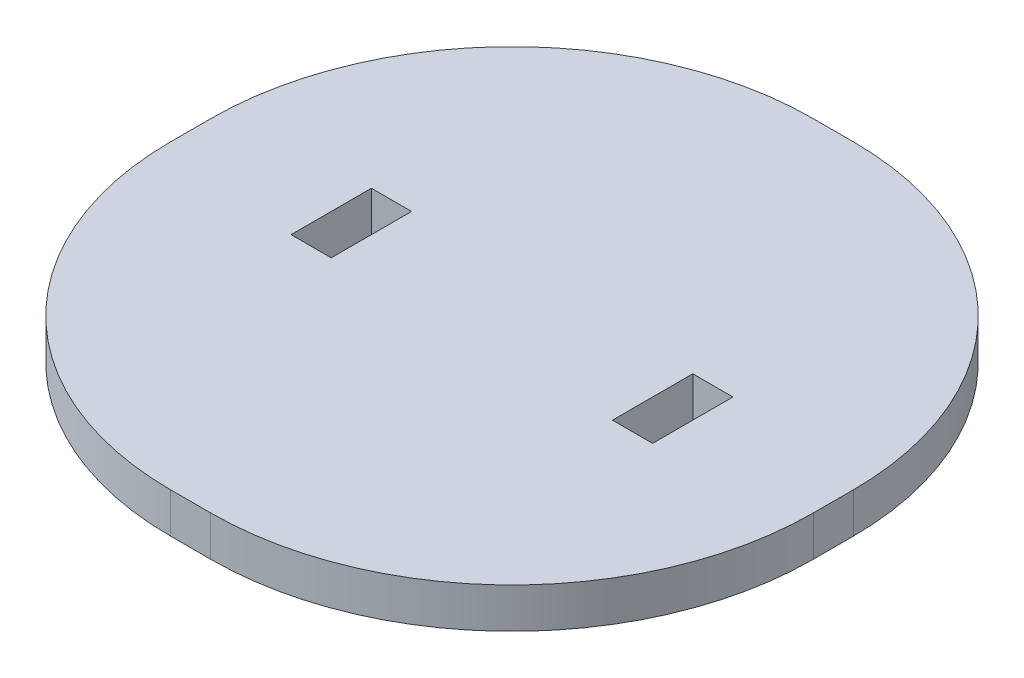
from build123d import *

# Parameters (mm, degrees)
SKETCH1_W           = 50.8
SKETCH1_H           = 50.8
BOSS_EXTRUDE1_DEPTH = 1.5875
SKETCH2_W           = 3.175
SKETCH2_H           = 6.35
CUT_EXTRUDE1_DEPTH  = 37.061067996
FILLET1_R           = 23.8125


with BuildPart() as part:
    # Sketch1 → Boss-Extrude1 (new, symmetric)
    with BuildSketch(Plane(origin=(0, 0, 0), x_dir=(1, 0, 0), z_dir=(0, 1, 0))):
        Rectangle(SKETCH1_W, SKETCH1_H)
    extrude(amount=BOSS_EXTRUDE1_DEPTH, both=True)

    # Sketch2 → Cut-Extrude1 (cut, through all)
    with BuildSketch(Plane(origin=(0, 1.5875, 0), x_dir=(1, 0, 0), z_dir=(0, 1, 0))):
        with Locations((-12.7, 0)):
            Rectangle(SKETCH2_W, SKETCH2_H)
        with Locations((12.7, 0)):
            Rectangle(SKETCH2_W, SKETCH2_H)
    extrude(amount=-CUT_EXTRUDE1_DEPTH, mode=Mode.SUBTRACT)

    # Fillet1
    fillet1_edges = [part.edges().sort_by_distance(p)[0] for p in [
        (25.4, 0, 25.4),
        (-25.4, 0, 25.4),
        (-25.4, 0, -25.4),
        (25.4, 0, -25.4),
    ]]
    fillet(fillet1_edges, radius=FILLET1_R)


solid = part.part
